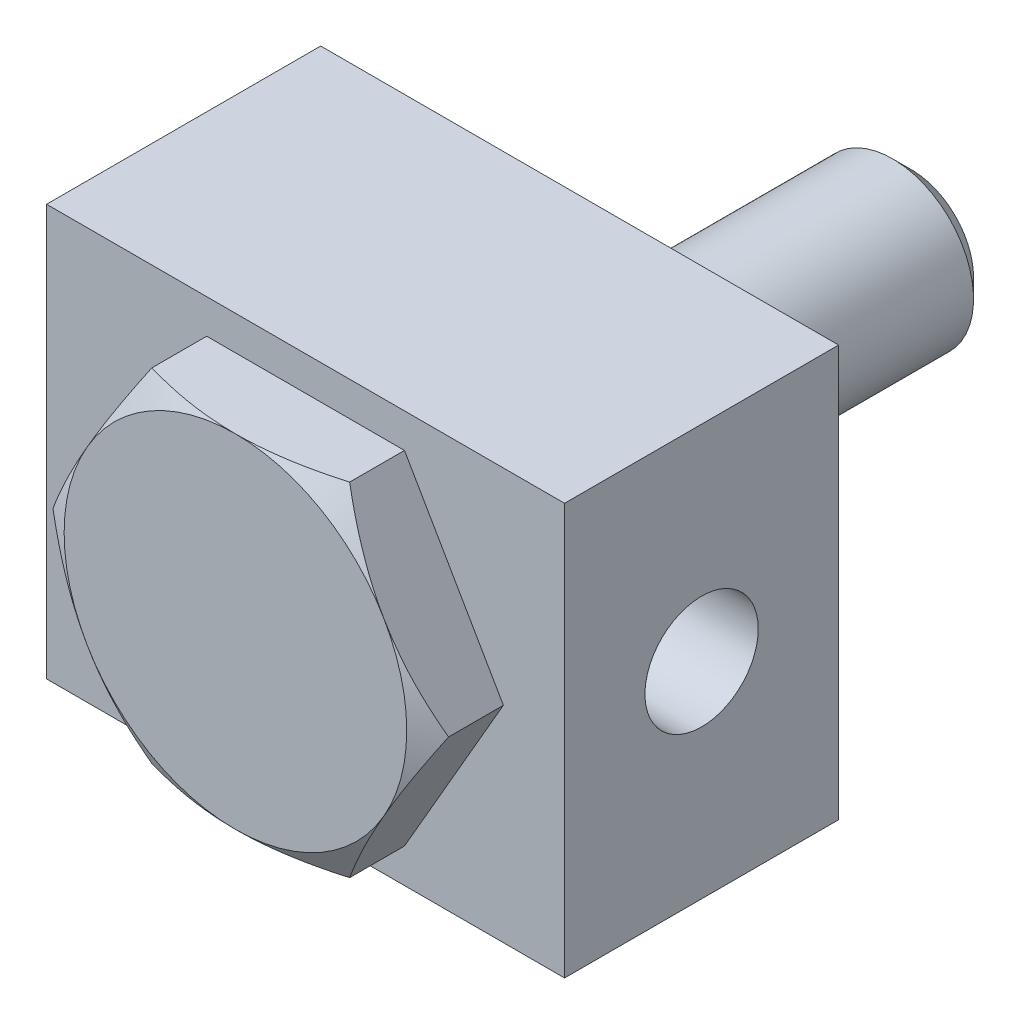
ISO-10303-21;
HEADER;
FILE_DESCRIPTION(('STEP AP214'),'2;1');
FILE_NAME('part.step','',(''),(''),'','','');
FILE_SCHEMA(('AUTOMOTIVE_DESIGN { 1 0 10303 214 1 1 1 1 }'));
ENDSEC;
DATA;
#1=APPLICATION_CONTEXT('core data for automotive mechanical design processes');
#2=APPLICATION_PROTOCOL_DEFINITION('international standard','automotive_design',2000,#1);
#3=PRODUCT_CONTEXT('',#1,'mechanical');
#4=PRODUCT('Part','Part','',(#3));
#5=PRODUCT_RELATED_PRODUCT_CATEGORY('part','',(#4));
#6=PRODUCT_DEFINITION_FORMATION('','',#4);
#7=PRODUCT_DEFINITION_CONTEXT('part definition',#1,'design');
#8=PRODUCT_DEFINITION('design','',#6,#7);
#9=PRODUCT_DEFINITION_SHAPE('','',#8);
#10=(LENGTH_UNIT() NAMED_UNIT(*) SI_UNIT(.MILLI.,.METRE.));
#11=(NAMED_UNIT(*) PLANE_ANGLE_UNIT() SI_UNIT($,.RADIAN.));
#12=(NAMED_UNIT(*) SI_UNIT($,.STERADIAN.) SOLID_ANGLE_UNIT());
#13=UNCERTAINTY_MEASURE_WITH_UNIT(LENGTH_MEASURE(1.E-05),#10,'distance_accuracy_value','');
#14=(GEOMETRIC_REPRESENTATION_CONTEXT(3) GLOBAL_UNCERTAINTY_ASSIGNED_CONTEXT((#13)) GLOBAL_UNIT_ASSIGNED_CONTEXT((#10,
#11,#12)) REPRESENTATION_CONTEXT('',''));
#15=CARTESIAN_POINT('',(0.,0.,0.));
#16=DIRECTION('',(0.,0.,1.));
#17=DIRECTION('',(1.,0.,0.));
#18=AXIS2_PLACEMENT_3D('',#15,#16,#17);
#19=CARTESIAN_POINT('',(-18.3308710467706,31.75,70.3));
#20=DIRECTION('',(0.866025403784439,-0.5,0.));
#21=DIRECTION('',(0.5,0.866025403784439,0.));
#22=AXIS2_PLACEMENT_3D('',#19,#20,#21);
#23=PLANE('',#22);
#24=CARTESIAN_POINT('',(-18.3307555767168,31.7502,62.4641377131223));
#25=CARTESIAN_POINT('',(-18.7336598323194,31.0523493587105,62.6967369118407));
#26=CARTESIAN_POINT('',(-19.13813562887,30.3517767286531,62.9187809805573));
#27=CARTESIAN_POINT('',(-19.9503306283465,28.9450137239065,63.3388249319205));
#28=CARTESIAN_POINT('',(-20.358050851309,28.238821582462,63.5368169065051));
#29=CARTESIAN_POINT('',(-21.1775313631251,26.8194397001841,63.906099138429));
#30=CARTESIAN_POINT('',(-21.5892988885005,26.1062374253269,64.0773256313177));
#31=CARTESIAN_POINT('',(-22.4156776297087,24.6749074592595,64.3893882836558));
#32=CARTESIAN_POINT('',(-22.8302885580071,23.9567802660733,64.5302274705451));
#33=CARTESIAN_POINT('',(-23.6517563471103,22.5339563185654,64.7755371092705));
#34=CARTESIAN_POINT('',(-24.0585522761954,21.8293651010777,64.8808188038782));
#35=CARTESIAN_POINT('',(-24.8740080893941,20.4169542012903,65.0573518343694));
#36=CARTESIAN_POINT('',(-25.2826680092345,19.7091344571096,65.1286025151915));
#37=CARTESIAN_POINT('',(-26.100674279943,18.2923060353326,65.2352744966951));
#38=CARTESIAN_POINT('',(-26.5100192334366,17.5832997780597,65.2707383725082));
#39=CARTESIAN_POINT('',(-27.3290869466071,16.1646328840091,65.3050740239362));
#40=CARTESIAN_POINT('',(-27.7388096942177,15.4549722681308,65.3039469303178));
#41=CARTESIAN_POINT('',(-28.5047899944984,14.1282554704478,65.2676569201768));
#42=CARTESIAN_POINT('',(-28.8611021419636,13.5111047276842,65.2369192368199));
#43=CARTESIAN_POINT('',(-29.5728766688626,12.2782750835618,65.1483534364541));
#44=CARTESIAN_POINT('',(-29.9283390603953,11.6625961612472,65.0905257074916));
#45=CARTESIAN_POINT('',(-30.6382785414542,10.4329449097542,64.9487854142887));
#46=CARTESIAN_POINT('',(-30.9927544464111,9.81897463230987,64.8648492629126));
#47=CARTESIAN_POINT('',(-31.7000213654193,8.59395239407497,64.6723649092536));
#48=CARTESIAN_POINT('',(-32.0528123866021,7.98290042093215,64.5638168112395));
#49=CARTESIAN_POINT('',(-32.7641994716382,6.75074184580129,64.3211744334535));
#50=CARTESIAN_POINT('',(-33.1227517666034,6.12971105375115,64.186569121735));
#51=CARTESIAN_POINT('',(-33.8376618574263,4.89145045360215,63.895403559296));
#52=CARTESIAN_POINT('',(-34.1940193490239,4.27422117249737,63.7388403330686));
#53=CARTESIAN_POINT('',(-34.9037042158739,3.04501092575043,63.4061282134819));
#54=CARTESIAN_POINT('',(-35.2570361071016,2.43302213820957,63.2300176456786));
#55=CARTESIAN_POINT('',(-35.9612560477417,1.21327742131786,62.8599677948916));
#56=CARTESIAN_POINT('',(-36.3121447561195,0.605520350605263,62.6660335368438));
#57=CARTESIAN_POINT('',(-36.6618575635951,-0.000200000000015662,62.4641377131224));
#58=B_SPLINE_CURVE_WITH_KNOTS('',3,(#24,#25,#26,#27,#28,#29,#30,#31,#32,#33,#34,#35,#36,#37,#38,
#39,#40,#41,#42,#43,#44,#45,#46,#47,#48,#49,#50,#51,#52,#53,#54,#55,#56,#57),.UNSPECIFIED.,.F.,
.F.,(4,2,2,2,2,2,2,2,2,2,2,2,2,2,2,2,4),(0.,2.51618738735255,5.03319984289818,7.55612017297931,
10.078789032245,12.5392457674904,14.999749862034,17.4573232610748,19.9148207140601,
22.0541658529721,24.1934803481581,26.3347332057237,28.4759769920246,30.6644883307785,
32.8532965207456,35.0378865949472,37.2218626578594),.UNSPECIFIED.);
#59=CARTESIAN_POINT('',(-18.3308710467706,31.75,62.464204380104));
#60=VERTEX_POINT('',#59);
#61=CARTESIAN_POINT('',(-27.496306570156,15.875,65.3));
#62=VERTEX_POINT('',#61);
#63=EDGE_CURVE('E110',#60,#62,#58,.T.);
#64=ORIENTED_EDGE('',*,*,#63,.F.);
#65=DIRECTION('',(0.,0.,-1.));
#66=VECTOR('',#65,1.);
#67=CARTESIAN_POINT('',(-18.3308710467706,31.75,70.3));
#68=LINE('',#67,#66);
#69=CARTESIAN_POINT('',(-18.3308710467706,31.75,52.3));
#70=VERTEX_POINT('',#69);
#71=EDGE_CURVE('E387',#60,#70,#68,.T.);
#72=ORIENTED_EDGE('',*,*,#71,.T.);
#73=DIRECTION('',(-0.5,-0.866025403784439,0.));
#74=VECTOR('',#73,1.);
#75=CARTESIAN_POINT('',(-18.3308710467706,31.75,52.3));
#76=LINE('',#75,#74);
#77=CARTESIAN_POINT('',(-36.6617420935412,0.,52.3));
#78=VERTEX_POINT('',#77);
#79=EDGE_CURVE('E119',#70,#78,#76,.T.);
#80=ORIENTED_EDGE('',*,*,#79,.T.);
#81=DIRECTION('',(0.,0.,-1.));
#82=VECTOR('',#81,1.);
#83=CARTESIAN_POINT('',(-36.6617420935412,0.,70.3));
#84=LINE('',#83,#82);
#85=CARTESIAN_POINT('',(-36.6617420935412,0.,62.464204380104));
#86=VERTEX_POINT('',#85);
#87=EDGE_CURVE('E138',#86,#78,#84,.T.);
#88=ORIENTED_EDGE('',*,*,#87,.F.);
#89=EDGE_CURVE('E120',#62,#86,#58,.T.);
#90=ORIENTED_EDGE('',*,*,#89,.F.);
#91=EDGE_LOOP('',(#64,#72,#80,#88,#90));
#92=FACE_BOUND('',#91,.T.);
#93=ADVANCED_FACE('F16',(#92),#23,.F.);
#94=CARTESIAN_POINT('',(-36.6617420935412,0.,70.3));
#95=DIRECTION('',(0.866025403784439,0.5,0.));
#96=DIRECTION('',(-0.5,0.866025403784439,0.));
#97=AXIS2_PLACEMENT_3D('',#94,#95,#96);
#98=PLANE('',#97);
#99=CARTESIAN_POINT('',(-36.6618575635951,0.000199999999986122,62.4641377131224));
#100=CARTESIAN_POINT('',(-36.2589533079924,-0.69765064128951,62.6967369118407));
#101=CARTESIAN_POINT('',(-35.8544775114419,-1.39822327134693,62.9187809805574));
#102=CARTESIAN_POINT('',(-35.0422825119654,-2.80498627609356,63.3388249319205));
#103=CARTESIAN_POINT('',(-34.6345622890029,-3.51117841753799,63.5368169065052));
#104=CARTESIAN_POINT('',(-33.8150817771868,-4.93056029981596,63.906099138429));
#105=CARTESIAN_POINT('',(-33.4033142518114,-5.64376257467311,64.0773256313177));
#106=CARTESIAN_POINT('',(-32.5769355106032,-7.07509254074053,64.3893882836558));
#107=CARTESIAN_POINT('',(-32.1623245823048,-7.79321973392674,64.5302274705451));
#108=CARTESIAN_POINT('',(-31.3408567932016,-9.21604368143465,64.7755371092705));
#109=CARTESIAN_POINT('',(-30.9340608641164,-9.92063489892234,64.8808188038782));
#110=CARTESIAN_POINT('',(-30.1186050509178,-11.3330457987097,65.0573518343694));
#111=CARTESIAN_POINT('',(-29.7099451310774,-12.0408655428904,65.1286025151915));
#112=CARTESIAN_POINT('',(-28.8919388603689,-13.4576939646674,65.2352744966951));
#113=CARTESIAN_POINT('',(-28.4825939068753,-14.1667002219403,65.2707383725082));
#114=CARTESIAN_POINT('',(-27.6635261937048,-15.5853671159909,65.3050740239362));
#115=CARTESIAN_POINT('',(-27.2538034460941,-16.2950277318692,65.3039469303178));
#116=CARTESIAN_POINT('',(-26.4878231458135,-17.6217445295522,65.2676569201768));
#117=CARTESIAN_POINT('',(-26.1315109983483,-18.2388952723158,65.2369192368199));
#118=CARTESIAN_POINT('',(-25.4197364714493,-19.4717249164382,65.1483534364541));
#119=CARTESIAN_POINT('',(-25.0642740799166,-20.0874038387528,65.0905257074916));
#120=CARTESIAN_POINT('',(-24.3543345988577,-21.3170550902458,64.9487854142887));
#121=CARTESIAN_POINT('',(-23.9998586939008,-21.9310253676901,64.8648492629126));
#122=CARTESIAN_POINT('',(-23.2925917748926,-23.156047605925,64.6723649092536));
#123=CARTESIAN_POINT('',(-22.9398007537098,-23.7670995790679,64.5638168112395));
#124=CARTESIAN_POINT('',(-22.2284136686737,-24.9992581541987,64.3211744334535));
#125=CARTESIAN_POINT('',(-21.8698613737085,-25.6202889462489,64.1865691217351));
#126=CARTESIAN_POINT('',(-21.1549512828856,-26.8585495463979,63.895403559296));
#127=CARTESIAN_POINT('',(-20.798593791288,-27.4757788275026,63.7388403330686));
#128=CARTESIAN_POINT('',(-20.088908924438,-28.7049890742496,63.4061282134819));
#129=CARTESIAN_POINT('',(-19.7355770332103,-29.3169778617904,63.2300176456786));
#130=CARTESIAN_POINT('',(-19.0313570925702,-30.5367225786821,62.8599677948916));
#131=CARTESIAN_POINT('',(-18.6804683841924,-31.1444796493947,62.6660335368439));
#132=CARTESIAN_POINT('',(-18.3307555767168,-31.7502,62.4641377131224));
#133=B_SPLINE_CURVE_WITH_KNOTS('',3,(#99,#100,#101,#102,#103,#104,#105,#106,#107,#108,#109,#110,
#111,#112,#113,#114,#115,#116,#117,#118,#119,#120,#121,#122,#123,#124,#125,#126,#127,#128,#129,
#130,#131,#132),.UNSPECIFIED.,.F.,.F.,(4,2,2,2,2,2,2,2,2,2,2,2,2,2,2,2,4),(0.,2.51618738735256,
5.03319984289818,7.5561201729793,10.078789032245,12.5392457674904,14.999749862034,
17.4573232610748,19.9148207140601,22.054165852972,24.193480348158,26.3347332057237,
28.4759769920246,30.6644883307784,32.8532965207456,35.0378865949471,37.2218626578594),.UNSPECIFIED.);
#134=CARTESIAN_POINT('',(-27.496306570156,-15.875,65.3));
#135=VERTEX_POINT('',#134);
#136=EDGE_CURVE('E127',#86,#135,#133,.T.);
#137=ORIENTED_EDGE('',*,*,#136,.F.);
#138=ORIENTED_EDGE('',*,*,#87,.T.);
#139=DIRECTION('',(0.5,-0.866025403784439,0.));
#140=VECTOR('',#139,1.);
#141=CARTESIAN_POINT('',(-36.6617420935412,0.,52.3));
#142=LINE('',#141,#140);
#143=CARTESIAN_POINT('',(-18.3308710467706,-31.75,52.3));
#144=VERTEX_POINT('',#143);
#145=EDGE_CURVE('E395',#78,#144,#142,.T.);
#146=ORIENTED_EDGE('',*,*,#145,.T.);
#147=DIRECTION('',(0.,0.,-1.));
#148=VECTOR('',#147,1.);
#149=CARTESIAN_POINT('',(-18.3308710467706,-31.75,70.3));
#150=LINE('',#149,#148);
#151=CARTESIAN_POINT('',(-18.3308710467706,-31.75,62.464204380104));
#152=VERTEX_POINT('',#151);
#153=EDGE_CURVE('E216',#152,#144,#150,.T.);
#154=ORIENTED_EDGE('',*,*,#153,.F.);
#155=EDGE_CURVE('E139',#135,#152,#133,.T.);
#156=ORIENTED_EDGE('',*,*,#155,.F.);
#157=EDGE_LOOP('',(#137,#138,#146,#154,#156));
#158=FACE_BOUND('',#157,.T.);
#159=ADVANCED_FACE('F202',(#158),#98,.F.);
#160=CARTESIAN_POINT('',(-18.3308710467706,-31.75,70.3));
#161=DIRECTION('',(0.,1.,0.));
#162=DIRECTION('',(-1.,0.,0.));
#163=AXIS2_PLACEMENT_3D('',#160,#161,#162);
#164=PLANE('',#163);
#165=CARTESIAN_POINT('',(-49.0609987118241,-31.75,49.8914574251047));
#166=CARTESIAN_POINT('',(-48.3684107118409,-31.75,50.2271485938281));
#167=CARTESIAN_POINT('',(-47.6750046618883,-31.75,50.5611570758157));
#168=CARTESIAN_POINT('',(-46.2863868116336,-31.75,51.2254164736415));
#169=CARTESIAN_POINT('',(-45.5911749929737,-31.75,51.5556673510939));
#170=CARTESIAN_POINT('',(-44.1986810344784,-31.75,52.2120638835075));
#171=CARTESIAN_POINT('',(-43.5013985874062,-31.75,52.5382088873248));
#172=CARTESIAN_POINT('',(-42.1046897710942,-31.75,53.1858689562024));
#173=CARTESIAN_POINT('',(-41.4052634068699,-31.75,53.5073840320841));
#174=CARTESIAN_POINT('',(-39.29574648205,-31.75,54.4677329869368));
#175=CARTESIAN_POINT('',(-37.8820802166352,-31.75,55.0987453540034));
#176=CARTESIAN_POINT('',(-35.0434372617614,-31.75,56.3347449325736));
#177=CARTESIAN_POINT('',(-33.6184611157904,-31.75,56.9397333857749));
#178=CARTESIAN_POINT('',(-31.4481556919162,-31.75,57.8317691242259));
#179=CARTESIAN_POINT('',(-30.7078021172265,-31.75,58.1309335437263));
#180=CARTESIAN_POINT('',(-29.2231292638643,-31.75,58.7192803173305));
#181=CARTESIAN_POINT('',(-28.4788099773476,-31.75,59.008462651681));
#182=CARTESIAN_POINT('',(-26.9857641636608,-31.75,59.5755330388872));
#183=CARTESIAN_POINT('',(-26.2370370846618,-31.75,59.8534196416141));
#184=CARTESIAN_POINT('',(-24.7349201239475,-31.75,60.3963012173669));
#185=CARTESIAN_POINT('',(-23.9815302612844,-31.75,60.6612962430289));
#186=CARTESIAN_POINT('',(-22.4712971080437,-31.75,61.1760941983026));
#187=CARTESIAN_POINT('',(-21.7144642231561,-31.75,61.4259275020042));
#188=CARTESIAN_POINT('',(-20.1955328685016,-31.75,61.90898962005));
#189=CARTESIAN_POINT('',(-19.4334343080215,-31.75,62.1422181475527));
#190=CARTESIAN_POINT('',(-17.1392161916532,-31.75,62.8136001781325));
#191=CARTESIAN_POINT('',(-15.5985913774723,-31.75,63.2236522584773));
#192=CARTESIAN_POINT('',(-13.2752970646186,-31.75,63.7663407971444));
#193=CARTESIAN_POINT('',(-12.5009089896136,-31.75,63.9348146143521));
#194=CARTESIAN_POINT('',(-10.9468685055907,-31.75,64.2456093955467));
#195=CARTESIAN_POINT('',(-10.1672162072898,-31.75,64.3879309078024));
#196=CARTESIAN_POINT('',(-8.60321979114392,-31.75,64.6438959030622));
#197=CARTESIAN_POINT('',(-7.81887581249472,-31.75,64.7575402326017));
#198=CARTESIAN_POINT('',(-6.24629654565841,-31.75,64.953884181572));
#199=CARTESIAN_POINT('',(-5.4580612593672,-31.75,65.036583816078));
#200=CARTESIAN_POINT('',(-3.88905799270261,-31.75,65.1683616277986));
#201=CARTESIAN_POINT('',(-3.10832565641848,-31.75,65.2178617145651));
#202=CARTESIAN_POINT('',(-1.54546751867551,-31.75,65.2838124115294));
#203=CARTESIAN_POINT('',(-0.763341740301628,-31.75,65.3002635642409));
#204=CARTESIAN_POINT('',(0.80090033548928,-31.75,65.2997300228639));
#205=CARTESIAN_POINT('',(1.58301663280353,-31.75,65.2827450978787));
#206=CARTESIAN_POINT('',(3.14586968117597,-31.75,65.215734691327));
#207=CARTESIAN_POINT('',(3.92660636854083,-31.75,65.1657077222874));
#208=CARTESIAN_POINT('',(5.25717405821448,-31.75,65.0530813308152));
#209=CARTESIAN_POINT('',(5.80769556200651,-31.75,64.9984491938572));
#210=CARTESIAN_POINT('',(6.90700558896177,-31.75,64.8738397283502));
#211=CARTESIAN_POINT('',(7.45579406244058,-31.75,64.8038619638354));
#212=CARTESIAN_POINT('',(9.09913998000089,-31.75,64.5719348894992));
#213=CARTESIAN_POINT('',(10.1906479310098,-31.75,64.3879944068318));
#214=CARTESIAN_POINT('',(12.3643105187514,-31.75,63.96798055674));
#215=CARTESIAN_POINT('',(13.4464570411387,-31.75,63.7318659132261));
#216=CARTESIAN_POINT('',(15.5998610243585,-31.75,63.2147070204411));
#217=CARTESIAN_POINT('',(16.6711186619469,-31.75,62.9336635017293));
#218=CARTESIAN_POINT('',(18.8260878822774,-31.75,62.3268831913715));
#219=CARTESIAN_POINT('',(19.9095606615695,-31.75,62.0003045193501));
#220=CARTESIAN_POINT('',(22.065830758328,-31.75,61.3138040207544));
#221=CARTESIAN_POINT('',(23.1386280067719,-31.75,60.9538819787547));
#222=CARTESIAN_POINT('',(25.2740913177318,-31.75,60.2063728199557));
#223=CARTESIAN_POINT('',(26.3367607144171,-31.75,59.8187951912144));
#224=CARTESIAN_POINT('',(27.9241682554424,-31.75,59.22007093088));
#225=CARTESIAN_POINT('',(28.452204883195,-31.75,59.0176031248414));
#226=CARTESIAN_POINT('',(29.5062159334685,-31.75,58.6073631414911));
#227=CARTESIAN_POINT('',(30.0321903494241,-31.75,58.399590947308));
#228=CARTESIAN_POINT('',(31.941261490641,-31.75,57.6352911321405));
#229=CARTESIAN_POINT('',(33.3186160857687,-31.75,57.064387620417));
#230=CARTESIAN_POINT('',(36.0620094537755,-31.75,55.8959695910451));
#231=CARTESIAN_POINT('',(37.4280475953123,-31.75,55.2984536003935));
#232=CARTESIAN_POINT('',(40.1508563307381,-31.75,54.081983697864));
#233=CARTESIAN_POINT('',(41.5076249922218,-31.75,53.4630254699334));
#234=CARTESIAN_POINT('',(44.2131157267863,-31.75,52.2078748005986));
#235=CARTESIAN_POINT('',(45.561837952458,-31.75,51.5716826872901));
#236=CARTESIAN_POINT('',(48.2539031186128,-31.75,50.2845467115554));
#237=CARTESIAN_POINT('',(49.5972391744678,-31.75,49.6335884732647));
#238=CARTESIAN_POINT('',(52.2781978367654,-31.75,48.3200139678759));
#239=CARTESIAN_POINT('',(53.6158204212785,-31.75,47.6573976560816));
#240=CARTESIAN_POINT('',(56.2860541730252,-31.75,46.3225321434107));
#241=CARTESIAN_POINT('',(57.6186658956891,-31.75,45.6502840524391));
#242=CARTESIAN_POINT('',(60.2797370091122,-31.75,44.2976313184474));
#243=CARTESIAN_POINT('',(61.6081964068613,-31.75,43.6172266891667));
#244=CARTESIAN_POINT('',(64.1545838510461,-31.75,42.3046429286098));
#245=CARTESIAN_POINT('',(65.3727877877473,-31.75,41.6729986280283));
#246=CARTESIAN_POINT('',(67.8065601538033,-31.75,40.4046512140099));
#247=CARTESIAN_POINT('',(69.0221285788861,-31.75,39.7679480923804));
#248=CARTESIAN_POINT('',(72.6654502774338,-31.75,37.8512322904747));
#249=CARTESIAN_POINT('',(75.0897489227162,-31.75,36.5646499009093));
#250=CARTESIAN_POINT('',(78.7179557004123,-31.75,34.6262068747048));
#251=CARTESIAN_POINT('',(79.924569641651,-31.75,33.979396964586));
#252=CARTESIAN_POINT('',(82.3361973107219,-31.75,32.6827982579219));
#253=CARTESIAN_POINT('',(83.5412110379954,-31.75,32.0330094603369));
#254=CARTESIAN_POINT('',(85.9497498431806,-31.75,30.7308286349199));
#255=CARTESIAN_POINT('',(87.153274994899,-31.75,30.0784367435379));
#256=CARTESIAN_POINT('',(89.5590411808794,-31.75,28.7712938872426));
#257=CARTESIAN_POINT('',(90.7612822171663,-31.75,28.1165429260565));
#258=CARTESIAN_POINT('',(91.9629541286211,-31.75,27.4607501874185));
#259=B_SPLINE_CURVE_WITH_KNOTS('',3,(#165,#166,#167,#168,#169,#170,#171,#172,#173,#174,#175,
#176,#177,#178,#179,#180,#181,#182,#183,#184,#185,#186,#187,#188,#189,#190,#191,#192,#193,#194,
#195,#196,#197,#198,#199,#200,#201,#202,#203,#204,#205,#206,#207,#208,#209,#210,#211,#212,#213,
#214,#215,#216,#217,#218,#219,#220,#221,#222,#223,#224,#225,#226,#227,#228,#229,#230,#231,#232,
#233,#234,#235,#236,#237,#238,#239,#240,#241,#242,#243,#244,#245,#246,#247,#248,#249,#250,#251,
#252,#253,#254,#255,#256,#257,#258),.UNSPECIFIED.,.F.,.F.,(4,2,2,2,2,2,2,2,2,2,2,2,2,2,2,2,2,2,
2,2,2,2,2,2,2,2,2,2,2,2,2,2,2,2,2,2,2,2,2,2,2,2,2,2,2,2,4),(0.,2.30896175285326,
4.61794707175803,6.92729406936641,9.23663566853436,13.8807459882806,18.5246344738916,
20.9201141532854,23.3155985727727,25.7113895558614,28.1071707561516,30.4979821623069,
32.8888348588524,37.668691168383,40.0458440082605,42.4229470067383,44.7999798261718,
47.1770114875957,49.5232318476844,51.8694136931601,54.2156117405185,56.5619154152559,
58.2213801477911,59.8808920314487,63.2000059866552,66.5217552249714,69.8434504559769,
73.2376744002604,76.6319202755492,80.025007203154,81.721552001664,83.4181021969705,
87.890651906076,92.3634494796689,96.8371526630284,101.310770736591,105.788948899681,
110.267144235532,114.744827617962,119.222503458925,123.339158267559,127.455819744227,
135.689382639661,139.796511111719,143.903641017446,148.01055839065,152.117469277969),.UNSPECIFIED.);
#260=CARTESIAN_POINT('',(0.,-31.75,65.3));
#261=VERTEX_POINT('',#260);
#262=EDGE_CURVE('E196',#152,#261,#259,.T.);
#263=ORIENTED_EDGE('',*,*,#262,.F.);
#264=ORIENTED_EDGE('',*,*,#153,.T.);
#265=DIRECTION('',(1.,0.,0.));
#266=VECTOR('',#265,1.);
#267=CARTESIAN_POINT('',(-18.3308710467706,-31.75,52.3));
#268=LINE('',#267,#266);
#269=CARTESIAN_POINT('',(18.3308710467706,-31.75,52.3));
#270=VERTEX_POINT('',#269);
#271=EDGE_CURVE('E234',#144,#270,#268,.T.);
#272=ORIENTED_EDGE('',*,*,#271,.T.);
#273=DIRECTION('',(0.,0.,-1.));
#274=VECTOR('',#273,1.);
#275=CARTESIAN_POINT('',(18.3308710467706,-31.75,70.3));
#276=LINE('',#275,#274);
#277=CARTESIAN_POINT('',(18.3308710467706,-31.75,62.464204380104));
#278=VERTEX_POINT('',#277);
#279=EDGE_CURVE('E232',#278,#270,#276,.T.);
#280=ORIENTED_EDGE('',*,*,#279,.F.);
#281=EDGE_CURVE('E190',#261,#278,#259,.T.);
#282=ORIENTED_EDGE('',*,*,#281,.F.);
#283=EDGE_LOOP('',(#263,#264,#272,#280,#282));
#284=FACE_BOUND('',#283,.T.);
#285=ADVANCED_FACE('F198',(#284),#164,.F.);
#286=CARTESIAN_POINT('',(18.3308710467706,-31.75,70.3));
#287=DIRECTION('',(-0.866025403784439,0.5,0.));
#288=DIRECTION('',(-0.5,-0.866025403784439,0.));
#289=AXIS2_PLACEMENT_3D('',#286,#287,#288);
#290=PLANE('',#289);
#291=CARTESIAN_POINT('',(18.3307555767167,-31.7502,62.4641377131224));
#292=CARTESIAN_POINT('',(18.7336598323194,-31.0523493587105,62.6967369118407));
#293=CARTESIAN_POINT('',(19.1381356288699,-30.3517767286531,62.9187809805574));
#294=CARTESIAN_POINT('',(19.9503306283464,-28.9450137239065,63.3388249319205));
#295=CARTESIAN_POINT('',(20.358050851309,-28.238821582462,63.5368169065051));
#296=CARTESIAN_POINT('',(21.177531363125,-26.8194397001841,63.9060991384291));
#297=CARTESIAN_POINT('',(21.5892988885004,-26.1062374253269,64.0773256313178));
#298=CARTESIAN_POINT('',(22.4156776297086,-24.6749074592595,64.3893882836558));
#299=CARTESIAN_POINT('',(22.8302885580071,-23.9567802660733,64.5302274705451));
#300=CARTESIAN_POINT('',(23.6517563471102,-22.5339563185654,64.7755371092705));
#301=CARTESIAN_POINT('',(24.0585522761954,-21.8293651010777,64.8808188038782));
#302=CARTESIAN_POINT('',(24.874008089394,-20.4169542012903,65.0573518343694));
#303=CARTESIAN_POINT('',(25.2826680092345,-19.7091344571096,65.1286025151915));
#304=CARTESIAN_POINT('',(26.1006742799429,-18.2923060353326,65.2352744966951));
#305=CARTESIAN_POINT('',(26.5100192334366,-17.5832997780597,65.2707383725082));
#306=CARTESIAN_POINT('',(27.3290869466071,-16.1646328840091,65.3050740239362));
#307=CARTESIAN_POINT('',(27.7388096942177,-15.4549722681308,65.3039469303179));
#308=CARTESIAN_POINT('',(28.5047899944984,-14.1282554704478,65.2676569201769));
#309=CARTESIAN_POINT('',(28.8611021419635,-13.5111047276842,65.2369192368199));
#310=CARTESIAN_POINT('',(29.5728766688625,-12.2782750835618,65.1483534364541));
#311=CARTESIAN_POINT('',(29.9283390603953,-11.6625961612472,65.0905257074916));
#312=CARTESIAN_POINT('',(30.6382785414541,-10.4329449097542,64.9487854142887));
#313=CARTESIAN_POINT('',(30.992754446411,-9.81897463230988,64.8648492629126));
#314=CARTESIAN_POINT('',(31.7000213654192,-8.59395239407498,64.6723649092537));
#315=CARTESIAN_POINT('',(32.0528123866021,-7.98290042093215,64.5638168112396));
#316=CARTESIAN_POINT('',(32.7641994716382,-6.75074184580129,64.3211744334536));
#317=CARTESIAN_POINT('',(33.1227517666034,-6.12971105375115,64.1865691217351));
#318=CARTESIAN_POINT('',(33.8376618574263,-4.89145045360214,63.895403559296));
#319=CARTESIAN_POINT('',(34.1940193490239,-4.27422117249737,63.7388403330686));
#320=CARTESIAN_POINT('',(34.9037042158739,-3.04501092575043,63.406128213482));
#321=CARTESIAN_POINT('',(35.2570361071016,-2.43302213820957,63.2300176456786));
#322=CARTESIAN_POINT('',(35.9612560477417,-1.21327742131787,62.8599677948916));
#323=CARTESIAN_POINT('',(36.3121447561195,-0.605520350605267,62.6660335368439));
#324=CARTESIAN_POINT('',(36.661857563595,0.000200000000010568,62.4641377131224));
#325=B_SPLINE_CURVE_WITH_KNOTS('',3,(#291,#292,#293,#294,#295,#296,#297,#298,#299,#300,#301,
#302,#303,#304,#305,#306,#307,#308,#309,#310,#311,#312,#313,#314,#315,#316,#317,#318,#319,#320,
#321,#322,#323,#324),.UNSPECIFIED.,.F.,.F.,(4,2,2,2,2,2,2,2,2,2,2,2,2,2,2,2,4),(0.,
2.51618738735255,5.03319984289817,7.5561201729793,10.078789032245,12.5392457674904,
14.999749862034,17.4573232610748,19.9148207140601,22.054165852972,24.193480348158,
26.3347332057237,28.4759769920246,30.6644883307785,32.8532965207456,35.0378865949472,
37.2218626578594),.UNSPECIFIED.);
#326=CARTESIAN_POINT('',(27.496306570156,-15.875,65.3));
#327=VERTEX_POINT('',#326);
#328=EDGE_CURVE('E197',#278,#327,#325,.T.);
#329=ORIENTED_EDGE('',*,*,#328,.F.);
#330=ORIENTED_EDGE('',*,*,#279,.T.);
#331=DIRECTION('',(0.5,0.866025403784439,0.));
#332=VECTOR('',#331,1.);
#333=CARTESIAN_POINT('',(18.3308710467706,-31.75,52.3));
#334=LINE('',#333,#332);
#335=CARTESIAN_POINT('',(36.6617420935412,0.,52.3));
#336=VERTEX_POINT('',#335);
#337=EDGE_CURVE('E393',#270,#336,#334,.T.);
#338=ORIENTED_EDGE('',*,*,#337,.T.);
#339=DIRECTION('',(0.,0.,-1.));
#340=VECTOR('',#339,1.);
#341=CARTESIAN_POINT('',(36.6617420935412,0.,70.3));
#342=LINE('',#341,#340);
#343=CARTESIAN_POINT('',(36.6617420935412,0.,62.464204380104));
#344=VERTEX_POINT('',#343);
#345=EDGE_CURVE('E238',#344,#336,#342,.T.);
#346=ORIENTED_EDGE('',*,*,#345,.F.);
#347=EDGE_CURVE('E184',#327,#344,#325,.T.);
#348=ORIENTED_EDGE('',*,*,#347,.F.);
#349=EDGE_LOOP('',(#329,#330,#338,#346,#348));
#350=FACE_BOUND('',#349,.T.);
#351=ADVANCED_FACE('F201',(#350),#290,.F.);
#352=CARTESIAN_POINT('',(36.6617420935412,0.,70.3));
#353=DIRECTION('',(-0.866025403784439,-0.5,0.));
#354=DIRECTION('',(0.5,-0.866025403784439,0.));
#355=AXIS2_PLACEMENT_3D('',#352,#353,#354);
#356=PLANE('',#355);
#357=CARTESIAN_POINT('',(36.661857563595,-0.000199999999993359,62.4641377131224));
#358=CARTESIAN_POINT('',(36.2589533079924,0.697650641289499,62.6967369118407));
#359=CARTESIAN_POINT('',(35.8544775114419,1.39822327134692,62.9187809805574));
#360=CARTESIAN_POINT('',(35.0422825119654,2.80498627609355,63.3388249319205));
#361=CARTESIAN_POINT('',(34.6345622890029,3.51117841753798,63.5368169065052));
#362=CARTESIAN_POINT('',(33.8150817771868,4.93056029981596,63.9060991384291));
#363=CARTESIAN_POINT('',(33.4033142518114,5.6437625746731,64.0773256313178));
#364=CARTESIAN_POINT('',(32.5769355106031,7.07509254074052,64.3893882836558));
#365=CARTESIAN_POINT('',(32.1623245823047,7.79321973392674,64.5302274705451));
#366=CARTESIAN_POINT('',(31.3408567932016,9.21604368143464,64.7755371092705));
#367=CARTESIAN_POINT('',(30.9340608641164,9.92063489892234,64.8808188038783));
#368=CARTESIAN_POINT('',(30.1186050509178,11.3330457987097,65.0573518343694));
#369=CARTESIAN_POINT('',(29.7099451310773,12.0408655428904,65.1286025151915));
#370=CARTESIAN_POINT('',(28.8919388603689,13.4576939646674,65.2352744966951));
#371=CARTESIAN_POINT('',(28.4825939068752,14.1667002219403,65.2707383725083));
#372=CARTESIAN_POINT('',(27.6635261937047,15.5853671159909,65.3050740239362));
#373=CARTESIAN_POINT('',(27.2538034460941,16.2950277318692,65.3039469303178));
#374=CARTESIAN_POINT('',(26.4878231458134,17.6217445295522,65.2676569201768));
#375=CARTESIAN_POINT('',(26.1315109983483,18.2388952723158,65.2369192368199));
#376=CARTESIAN_POINT('',(25.4197364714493,19.4717249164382,65.1483534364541));
#377=CARTESIAN_POINT('',(25.0642740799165,20.0874038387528,65.0905257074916));
#378=CARTESIAN_POINT('',(24.3543345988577,21.3170550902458,64.9487854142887));
#379=CARTESIAN_POINT('',(23.9998586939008,21.9310253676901,64.8648492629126));
#380=CARTESIAN_POINT('',(23.2925917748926,23.156047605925,64.6723649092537));
#381=CARTESIAN_POINT('',(22.9398007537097,23.7670995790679,64.5638168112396));
#382=CARTESIAN_POINT('',(22.2284136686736,24.9992581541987,64.3211744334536));
#383=CARTESIAN_POINT('',(21.8698613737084,25.6202889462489,64.1865691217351));
#384=CARTESIAN_POINT('',(21.1549512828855,26.8585495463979,63.895403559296));
#385=CARTESIAN_POINT('',(20.7985937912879,27.4757788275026,63.7388403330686));
#386=CARTESIAN_POINT('',(20.088908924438,28.7049890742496,63.406128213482));
#387=CARTESIAN_POINT('',(19.7355770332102,29.3169778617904,63.2300176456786));
#388=CARTESIAN_POINT('',(19.0313570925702,30.5367225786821,62.8599677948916));
#389=CARTESIAN_POINT('',(18.6804683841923,31.1444796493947,62.6660335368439));
#390=CARTESIAN_POINT('',(18.3307555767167,31.7502,62.4641377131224));
#391=B_SPLINE_CURVE_WITH_KNOTS('',3,(#357,#358,#359,#360,#361,#362,#363,#364,#365,#366,#367,
#368,#369,#370,#371,#372,#373,#374,#375,#376,#377,#378,#379,#380,#381,#382,#383,#384,#385,#386,
#387,#388,#389,#390),.UNSPECIFIED.,.F.,.F.,(4,2,2,2,2,2,2,2,2,2,2,2,2,2,2,2,4),(0.,
2.51618738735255,5.03319984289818,7.5561201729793,10.078789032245,12.5392457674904,
14.999749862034,17.4573232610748,19.9148207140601,22.0541658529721,24.1934803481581,
26.3347332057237,28.4759769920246,30.6644883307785,32.8532965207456,35.0378865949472,
37.2218626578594),.UNSPECIFIED.);
#392=CARTESIAN_POINT('',(27.496306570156,15.875,65.3));
#393=VERTEX_POINT('',#392);
#394=EDGE_CURVE('E398',#344,#393,#391,.T.);
#395=ORIENTED_EDGE('',*,*,#394,.F.);
#396=ORIENTED_EDGE('',*,*,#345,.T.);
#397=DIRECTION('',(-0.5,0.866025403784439,0.));
#398=VECTOR('',#397,1.);
#399=CARTESIAN_POINT('',(36.6617420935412,0.,52.3));
#400=LINE('',#399,#398);
#401=CARTESIAN_POINT('',(18.3308710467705,31.75,52.3));
#402=VERTEX_POINT('',#401);
#403=EDGE_CURVE('E386',#336,#402,#400,.T.);
#404=ORIENTED_EDGE('',*,*,#403,.T.);
#405=DIRECTION('',(0.,0.,-1.));
#406=VECTOR('',#405,1.);
#407=CARTESIAN_POINT('',(18.3308710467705,31.75,70.3));
#408=LINE('',#407,#406);
#409=CARTESIAN_POINT('',(18.3308710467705,31.75,62.464204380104));
#410=VERTEX_POINT('',#409);
#411=EDGE_CURVE('E241',#410,#402,#408,.T.);
#412=ORIENTED_EDGE('',*,*,#411,.F.);
#413=EDGE_CURVE('E177',#393,#410,#391,.T.);
#414=ORIENTED_EDGE('',*,*,#413,.F.);
#415=EDGE_LOOP('',(#395,#396,#404,#412,#414));
#416=FACE_BOUND('',#415,.T.);
#417=ADVANCED_FACE('F366',(#416),#356,.F.);
#418=CARTESIAN_POINT('',(18.3308710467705,31.75,70.3));
#419=DIRECTION('',(0.,-1.,0.));
#420=DIRECTION('',(0.,0.,-1.));
#421=AXIS2_PLACEMENT_3D('',#418,#419,#420);
#422=PLANE('',#421);
#423=CARTESIAN_POINT('',(-49.0609987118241,31.75,49.8914574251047));
#424=CARTESIAN_POINT('',(-48.3684107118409,31.75,50.2271485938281));
#425=CARTESIAN_POINT('',(-47.6750046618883,31.75,50.5611570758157));
#426=CARTESIAN_POINT('',(-46.2863868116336,31.75,51.2254164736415));
#427=CARTESIAN_POINT('',(-45.5911749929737,31.75,51.5556673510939));
#428=CARTESIAN_POINT('',(-44.1986810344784,31.75,52.2120638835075));
#429=CARTESIAN_POINT('',(-43.5013985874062,31.75,52.5382088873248));
#430=CARTESIAN_POINT('',(-42.1046897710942,31.75,53.1858689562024));
#431=CARTESIAN_POINT('',(-41.4052634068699,31.75,53.5073840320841));
#432=CARTESIAN_POINT('',(-39.29574648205,31.75,54.4677329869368));
#433=CARTESIAN_POINT('',(-37.8820802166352,31.75,55.0987453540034));
#434=CARTESIAN_POINT('',(-35.0434372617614,31.75,56.3347449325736));
#435=CARTESIAN_POINT('',(-33.6184611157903,31.75,56.9397333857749));
#436=CARTESIAN_POINT('',(-31.4481556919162,31.75,57.8317691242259));
#437=CARTESIAN_POINT('',(-30.7078021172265,31.75,58.1309335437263));
#438=CARTESIAN_POINT('',(-29.2231292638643,31.75,58.7192803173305));
#439=CARTESIAN_POINT('',(-28.4788099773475,31.75,59.008462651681));
#440=CARTESIAN_POINT('',(-26.9857641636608,31.75,59.5755330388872));
#441=CARTESIAN_POINT('',(-26.2370370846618,31.75,59.8534196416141));
#442=CARTESIAN_POINT('',(-24.7349201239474,31.75,60.3963012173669));
#443=CARTESIAN_POINT('',(-23.9815302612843,31.75,60.6612962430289));
#444=CARTESIAN_POINT('',(-22.4712971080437,31.75,61.1760941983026));
#445=CARTESIAN_POINT('',(-21.7144642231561,31.75,61.4259275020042));
#446=CARTESIAN_POINT('',(-20.1955328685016,31.75,61.90898962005));
#447=CARTESIAN_POINT('',(-19.4334343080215,31.75,62.1422181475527));
#448=CARTESIAN_POINT('',(-17.1392161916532,31.75,62.8136001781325));
#449=CARTESIAN_POINT('',(-15.5985913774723,31.75,63.2236522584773));
#450=CARTESIAN_POINT('',(-13.2752970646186,31.75,63.7663407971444));
#451=CARTESIAN_POINT('',(-12.5009089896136,31.75,63.9348146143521));
#452=CARTESIAN_POINT('',(-10.9468685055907,31.75,64.2456093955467));
#453=CARTESIAN_POINT('',(-10.1672162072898,31.75,64.3879309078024));
#454=CARTESIAN_POINT('',(-8.60321979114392,31.75,64.6438959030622));
#455=CARTESIAN_POINT('',(-7.81887581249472,31.75,64.7575402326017));
#456=CARTESIAN_POINT('',(-6.24629654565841,31.75,64.953884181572));
#457=CARTESIAN_POINT('',(-5.4580612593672,31.75,65.036583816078));
#458=CARTESIAN_POINT('',(-3.88905799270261,31.75,65.1683616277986));
#459=CARTESIAN_POINT('',(-3.10832565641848,31.75,65.2178617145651));
#460=CARTESIAN_POINT('',(-1.54546751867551,31.75,65.2838124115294));
#461=CARTESIAN_POINT('',(-0.763341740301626,31.75,65.3002635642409));
#462=CARTESIAN_POINT('',(0.800900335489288,31.75,65.2997300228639));
#463=CARTESIAN_POINT('',(1.58301663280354,31.75,65.2827450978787));
#464=CARTESIAN_POINT('',(3.14586968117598,31.75,65.215734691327));
#465=CARTESIAN_POINT('',(3.92660636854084,31.75,65.1657077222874));
#466=CARTESIAN_POINT('',(5.25717405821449,31.75,65.0530813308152));
#467=CARTESIAN_POINT('',(5.80769556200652,31.75,64.9984491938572));
#468=CARTESIAN_POINT('',(6.90700558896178,31.75,64.8738397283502));
#469=CARTESIAN_POINT('',(7.45579406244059,31.75,64.8038619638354));
#470=CARTESIAN_POINT('',(9.09913998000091,31.75,64.5719348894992));
#471=CARTESIAN_POINT('',(10.1906479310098,31.75,64.3879944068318));
#472=CARTESIAN_POINT('',(12.3643105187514,31.75,63.96798055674));
#473=CARTESIAN_POINT('',(13.4464570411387,31.75,63.7318659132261));
#474=CARTESIAN_POINT('',(15.5998610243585,31.75,63.2147070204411));
#475=CARTESIAN_POINT('',(16.6711186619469,31.75,62.9336635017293));
#476=CARTESIAN_POINT('',(18.8260878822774,31.75,62.3268831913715));
#477=CARTESIAN_POINT('',(19.9095606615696,31.75,62.00030451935));
#478=CARTESIAN_POINT('',(22.065830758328,31.75,61.3138040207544));
#479=CARTESIAN_POINT('',(23.138628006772,31.75,60.9538819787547));
#480=CARTESIAN_POINT('',(25.2740913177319,31.75,60.2063728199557));
#481=CARTESIAN_POINT('',(26.3367607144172,31.75,59.8187951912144));
#482=CARTESIAN_POINT('',(27.9241682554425,31.75,59.22007093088));
#483=CARTESIAN_POINT('',(28.452204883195,31.75,59.0176031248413));
#484=CARTESIAN_POINT('',(29.5062159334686,31.75,58.6073631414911));
#485=CARTESIAN_POINT('',(30.0321903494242,31.75,58.399590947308));
#486=CARTESIAN_POINT('',(31.9412614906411,31.75,57.6352911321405));
#487=CARTESIAN_POINT('',(33.3186160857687,31.75,57.064387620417));
#488=CARTESIAN_POINT('',(36.0620094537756,31.75,55.8959695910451));
#489=CARTESIAN_POINT('',(37.4280475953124,31.75,55.2984536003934));
#490=CARTESIAN_POINT('',(40.1508563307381,31.75,54.081983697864));
#491=CARTESIAN_POINT('',(41.5076249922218,31.75,53.4630254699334));
#492=CARTESIAN_POINT('',(44.2131157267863,31.75,52.2078748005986));
#493=CARTESIAN_POINT('',(45.5618379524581,31.75,51.5716826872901));
#494=CARTESIAN_POINT('',(48.2539031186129,31.75,50.2845467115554));
#495=CARTESIAN_POINT('',(49.5972391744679,31.75,49.6335884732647));
#496=CARTESIAN_POINT('',(52.2781978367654,31.75,48.3200139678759));
#497=CARTESIAN_POINT('',(53.6158204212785,31.75,47.6573976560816));
#498=CARTESIAN_POINT('',(56.2860541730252,31.75,46.3225321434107));
#499=CARTESIAN_POINT('',(57.6186658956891,31.75,45.6502840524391));
#500=CARTESIAN_POINT('',(60.2797370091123,31.75,44.2976313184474));
#501=CARTESIAN_POINT('',(61.6081964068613,31.75,43.6172266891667));
#502=CARTESIAN_POINT('',(64.1545838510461,31.75,42.3046429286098));
#503=CARTESIAN_POINT('',(65.3727877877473,31.75,41.6729986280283));
#504=CARTESIAN_POINT('',(67.8065601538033,31.75,40.4046512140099));
#505=CARTESIAN_POINT('',(69.0221285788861,31.75,39.7679480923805));
#506=CARTESIAN_POINT('',(72.6654502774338,31.75,37.8512322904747));
#507=CARTESIAN_POINT('',(75.0897489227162,31.75,36.5646499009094));
#508=CARTESIAN_POINT('',(78.7179557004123,31.75,34.6262068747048));
#509=CARTESIAN_POINT('',(79.924569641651,31.75,33.979396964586));
#510=CARTESIAN_POINT('',(82.3361973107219,31.75,32.6827982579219));
#511=CARTESIAN_POINT('',(83.5412110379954,31.75,32.0330094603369));
#512=CARTESIAN_POINT('',(85.9497498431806,31.75,30.7308286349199));
#513=CARTESIAN_POINT('',(87.153274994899,31.75,30.0784367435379));
#514=CARTESIAN_POINT('',(89.5590411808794,31.75,28.7712938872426));
#515=CARTESIAN_POINT('',(90.7612822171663,31.75,28.1165429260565));
#516=CARTESIAN_POINT('',(91.9629541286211,31.75,27.4607501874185));
#517=B_SPLINE_CURVE_WITH_KNOTS('',3,(#423,#424,#425,#426,#427,#428,#429,#430,#431,#432,#433,
#434,#435,#436,#437,#438,#439,#440,#441,#442,#443,#444,#445,#446,#447,#448,#449,#450,#451,#452,
#453,#454,#455,#456,#457,#458,#459,#460,#461,#462,#463,#464,#465,#466,#467,#468,#469,#470,#471,
#472,#473,#474,#475,#476,#477,#478,#479,#480,#481,#482,#483,#484,#485,#486,#487,#488,#489,#490,
#491,#492,#493,#494,#495,#496,#497,#498,#499,#500,#501,#502,#503,#504,#505,#506,#507,#508,#509,
#510,#511,#512,#513,#514,#515,#516),.UNSPECIFIED.,.F.,.F.,(4,2,2,2,2,2,2,2,2,2,2,2,2,2,2,2,2,2,
2,2,2,2,2,2,2,2,2,2,2,2,2,2,2,2,2,2,2,2,2,2,2,2,2,2,2,2,4),(0.,2.30896175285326,
4.61794707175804,6.92729406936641,9.23663566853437,13.8807459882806,18.5246344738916,
20.9201141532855,23.3155985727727,25.7113895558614,28.1071707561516,30.4979821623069,
32.8888348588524,37.668691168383,40.0458440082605,42.4229470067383,44.7999798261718,
47.1770114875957,49.5232318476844,51.8694136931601,54.2156117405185,56.5619154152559,
58.2213801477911,59.8808920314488,63.2000059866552,66.5217552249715,69.8434504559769,
73.2376744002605,76.6319202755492,80.0250072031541,81.721552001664,83.4181021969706,
87.890651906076,92.363449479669,96.8371526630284,101.310770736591,105.788948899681,
110.267144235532,114.744827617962,119.222503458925,123.339158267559,127.455819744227,
135.689382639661,139.796511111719,143.903641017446,148.01055839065,152.117469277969),.UNSPECIFIED.);
#518=CARTESIAN_POINT('',(0.,31.75,65.3));
#519=VERTEX_POINT('',#518);
#520=EDGE_CURVE('E378',#410,#519,#517,.F.);
#521=ORIENTED_EDGE('',*,*,#520,.F.);
#522=ORIENTED_EDGE('',*,*,#411,.T.);
#523=DIRECTION('',(-1.,0.,0.));
#524=VECTOR('',#523,1.);
#525=CARTESIAN_POINT('',(18.3308710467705,31.75,52.3));
#526=LINE('',#525,#524);
#527=EDGE_CURVE('E388',#402,#70,#526,.T.);
#528=ORIENTED_EDGE('',*,*,#527,.T.);
#529=ORIENTED_EDGE('',*,*,#71,.F.);
#530=EDGE_CURVE('E115',#519,#60,#517,.F.);
#531=ORIENTED_EDGE('',*,*,#530,.F.);
#532=EDGE_LOOP('',(#521,#522,#528,#529,#531));
#533=FACE_BOUND('',#532,.T.);
#534=ADVANCED_FACE('F164',(#533),#422,.F.);
#535=CARTESIAN_POINT('',(0.,0.,0.));
#536=DIRECTION('',(0.,0.,-1.));
#537=DIRECTION('',(-1.,0.,0.));
#538=AXIS2_PLACEMENT_3D('',#535,#536,#537);
#539=PLANE('',#538);
#540=CARTESIAN_POINT('',(0.,0.,0.));
#541=DIRECTION('',(0.,0.,-1.));
#542=DIRECTION('',(-1.,0.,0.));
#543=AXIS2_PLACEMENT_3D('',#540,#541,#542);
#544=CIRCLE('',#543,15.);
#545=CARTESIAN_POINT('',(-15.,0.,0.));
#546=VERTEX_POINT('',#545);
#547=EDGE_CURVE('E301',#546,#546,#544,.T.);
#548=ORIENTED_EDGE('',*,*,#547,.F.);
#549=EDGE_LOOP('',(#548));
#550=FACE_BOUND('',#549,.T.);
#551=CARTESIAN_POINT('',(0.,0.,0.));
#552=DIRECTION('',(0.,0.,-1.));
#553=DIRECTION('',(-1.,0.,0.));
#554=AXIS2_PLACEMENT_3D('',#551,#552,#553);
#555=CIRCLE('',#554,23.85);
#556=CARTESIAN_POINT('',(-23.85,0.,0.));
#557=VERTEX_POINT('',#556);
#558=EDGE_CURVE('E246',#557,#557,#555,.T.);
#559=ORIENTED_EDGE('',*,*,#558,.T.);
#560=EDGE_LOOP('',(#559));
#561=FACE_BOUND('',#560,.T.);
#562=ADVANCED_FACE('F324',(#550,#561),#539,.T.);
#563=CARTESIAN_POINT('',(0.,0.,0.));
#564=DIRECTION('',(0.,0.,1.));
#565=DIRECTION('',(1.,0.,0.));
#566=AXIS2_PLACEMENT_3D('',#563,#564,#565);
#567=CYLINDRICAL_SURFACE('',#566,23.85);
#568=ORIENTED_EDGE('',*,*,#558,.F.);
#569=EDGE_LOOP('',(#568));
#570=FACE_BOUND('',#569,.T.);
#571=CARTESIAN_POINT('',(0.,0.,1.5));
#572=DIRECTION('',(0.,0.,1.));
#573=DIRECTION('',(1.,0.,0.));
#574=AXIS2_PLACEMENT_3D('',#571,#572,#573);
#575=CIRCLE('',#574,23.85);
#576=CARTESIAN_POINT('',(23.85,0.,1.5));
#577=VERTEX_POINT('',#576);
#578=EDGE_CURVE('E250',#577,#577,#575,.F.);
#579=ORIENTED_EDGE('',*,*,#578,.T.);
#580=EDGE_LOOP('',(#579));
#581=FACE_BOUND('',#580,.T.);
#582=ADVANCED_FACE('F351',(#570,#581),#567,.T.);
#583=CARTESIAN_POINT('',(48.,-38.1,1.5));
#584=DIRECTION('',(0.,0.,1.));
#585=DIRECTION('',(1.,0.,0.));
#586=AXIS2_PLACEMENT_3D('',#583,#584,#585);
#587=PLANE('',#586);
#588=DIRECTION('',(0.,1.,0.));
#589=VECTOR('',#588,1.);
#590=CARTESIAN_POINT('',(48.,38.1,1.5));
#591=LINE('',#590,#589);
#592=CARTESIAN_POINT('',(48.,-38.1,1.5));
#593=VERTEX_POINT('',#592);
#594=CARTESIAN_POINT('',(48.,38.1,1.5));
#595=VERTEX_POINT('',#594);
#596=EDGE_CURVE('E253',#593,#595,#591,.T.);
#597=ORIENTED_EDGE('',*,*,#596,.F.);
#598=DIRECTION('',(1.,0.,0.));
#599=VECTOR('',#598,1.);
#600=CARTESIAN_POINT('',(-48.,-38.1,1.5));
#601=LINE('',#600,#599);
#602=CARTESIAN_POINT('',(-48.,-38.1,1.5));
#603=VERTEX_POINT('',#602);
#604=EDGE_CURVE('E258',#603,#593,#601,.T.);
#605=ORIENTED_EDGE('',*,*,#604,.F.);
#606=DIRECTION('',(0.,-1.,0.));
#607=VECTOR('',#606,1.);
#608=CARTESIAN_POINT('',(-48.,38.1,1.5));
#609=LINE('',#608,#607);
#610=CARTESIAN_POINT('',(-48.,38.1,1.5));
#611=VERTEX_POINT('',#610);
#612=EDGE_CURVE('E267',#611,#603,#609,.T.);
#613=ORIENTED_EDGE('',*,*,#612,.F.);
#614=DIRECTION('',(-1.,0.,0.));
#615=VECTOR('',#614,1.);
#616=CARTESIAN_POINT('',(-48.,38.1,1.5));
#617=LINE('',#616,#615);
#618=EDGE_CURVE('E265',#595,#611,#617,.T.);
#619=ORIENTED_EDGE('',*,*,#618,.F.);
#620=EDGE_LOOP('',(#597,#605,#613,#619));
#621=FACE_BOUND('',#620,.T.);
#622=ORIENTED_EDGE('',*,*,#578,.F.);
#623=EDGE_LOOP('',(#622));
#624=FACE_BOUND('',#623,.T.);
#625=ADVANCED_FACE('F338',(#621,#624),#587,.F.);
#626=CARTESIAN_POINT('',(-48.,-38.1,52.3));
#627=DIRECTION('',(0.,1.,0.));
#628=DIRECTION('',(-1.,0.,0.));
#629=AXIS2_PLACEMENT_3D('',#626,#627,#628);
#630=PLANE('',#629);
#631=ORIENTED_EDGE('',*,*,#604,.T.);
#632=DIRECTION('',(0.,0.,-1.));
#633=VECTOR('',#632,1.);
#634=CARTESIAN_POINT('',(48.,-38.1,52.3));
#635=LINE('',#634,#633);
#636=CARTESIAN_POINT('',(48.,-38.1,52.3));
#637=VERTEX_POINT('',#636);
#638=EDGE_CURVE('E262',#637,#593,#635,.T.);
#639=ORIENTED_EDGE('',*,*,#638,.F.);
#640=DIRECTION('',(1.,0.,0.));
#641=VECTOR('',#640,1.);
#642=CARTESIAN_POINT('',(-48.,-38.1,52.3));
#643=LINE('',#642,#641);
#644=CARTESIAN_POINT('',(-48.,-38.1,52.3));
#645=VERTEX_POINT('',#644);
#646=EDGE_CURVE('E257',#645,#637,#643,.T.);
#647=ORIENTED_EDGE('',*,*,#646,.F.);
#648=DIRECTION('',(0.,0.,-1.));
#649=VECTOR('',#648,1.);
#650=CARTESIAN_POINT('',(-48.,-38.1,52.3));
#651=LINE('',#650,#649);
#652=EDGE_CURVE('E272',#645,#603,#651,.T.);
#653=ORIENTED_EDGE('',*,*,#652,.T.);
#654=EDGE_LOOP('',(#631,#639,#647,#653));
#655=FACE_BOUND('',#654,.T.);
#656=ADVANCED_FACE('F334',(#655),#630,.F.);
#657=CARTESIAN_POINT('',(-48.,38.1,52.3));
#658=DIRECTION('',(1.,0.,0.));
#659=DIRECTION('',(0.,1.,0.));
#660=AXIS2_PLACEMENT_3D('',#657,#658,#659);
#661=PLANE('',#660);
#662=CARTESIAN_POINT('',(-48.,0.,26.9));
#663=DIRECTION('',(1.,0.,0.));
#664=DIRECTION('',(0.,0.,-1.));
#665=AXIS2_PLACEMENT_3D('',#662,#663,#664);
#666=CIRCLE('',#665,10.5);
#667=CARTESIAN_POINT('',(-48.,0.,16.4));
#668=VERTEX_POINT('',#667);
#669=EDGE_CURVE('E134',#668,#668,#666,.T.);
#670=ORIENTED_EDGE('',*,*,#669,.T.);
#671=EDGE_LOOP('',(#670));
#672=FACE_BOUND('',#671,.T.);
#673=ORIENTED_EDGE('',*,*,#652,.F.);
#674=DIRECTION('',(0.,-1.,0.));
#675=VECTOR('',#674,1.);
#676=CARTESIAN_POINT('',(-48.,38.1,52.3));
#677=LINE('',#676,#675);
#678=CARTESIAN_POINT('',(-48.,38.1,52.3));
#679=VERTEX_POINT('',#678);
#680=EDGE_CURVE('E249',#679,#645,#677,.T.);
#681=ORIENTED_EDGE('',*,*,#680,.F.);
#682=DIRECTION('',(0.,0.,-1.));
#683=VECTOR('',#682,1.);
#684=CARTESIAN_POINT('',(-48.,38.1,52.3));
#685=LINE('',#684,#683);
#686=EDGE_CURVE('E275',#679,#611,#685,.T.);
#687=ORIENTED_EDGE('',*,*,#686,.T.);
#688=ORIENTED_EDGE('',*,*,#612,.T.);
#689=EDGE_LOOP('',(#673,#681,#687,#688));
#690=FACE_BOUND('',#689,.T.);
#691=ADVANCED_FACE('F311',(#672,#690),#661,.F.);
#692=CARTESIAN_POINT('',(-48.,38.1,52.3));
#693=DIRECTION('',(0.,-1.,0.));
#694=DIRECTION('',(0.,0.,-1.));
#695=AXIS2_PLACEMENT_3D('',#692,#693,#694);
#696=PLANE('',#695);
#697=ORIENTED_EDGE('',*,*,#618,.T.);
#698=ORIENTED_EDGE('',*,*,#686,.F.);
#699=DIRECTION('',(-1.,0.,0.));
#700=VECTOR('',#699,1.);
#701=CARTESIAN_POINT('',(-48.,38.1,52.3));
#702=LINE('',#701,#700);
#703=CARTESIAN_POINT('',(48.,38.1,52.3));
#704=VERTEX_POINT('',#703);
#705=EDGE_CURVE('E254',#704,#679,#702,.T.);
#706=ORIENTED_EDGE('',*,*,#705,.F.);
#707=DIRECTION('',(0.,0.,-1.));
#708=VECTOR('',#707,1.);
#709=CARTESIAN_POINT('',(48.,38.1,52.3));
#710=LINE('',#709,#708);
#711=EDGE_CURVE('E278',#704,#595,#710,.T.);
#712=ORIENTED_EDGE('',*,*,#711,.T.);
#713=EDGE_LOOP('',(#697,#698,#706,#712));
#714=FACE_BOUND('',#713,.T.);
#715=ADVANCED_FACE('F322',(#714),#696,.F.);
#716=CARTESIAN_POINT('',(48.,38.1,52.3));
#717=DIRECTION('',(-1.,0.,0.));
#718=DIRECTION('',(0.,0.,1.));
#719=AXIS2_PLACEMENT_3D('',#716,#717,#718);
#720=PLANE('',#719);
#721=CARTESIAN_POINT('',(48.,0.,26.9));
#722=DIRECTION('',(1.,0.,0.));
#723=DIRECTION('',(0.,0.,-1.));
#724=AXIS2_PLACEMENT_3D('',#721,#722,#723);
#725=CIRCLE('',#724,10.5);
#726=CARTESIAN_POINT('',(48.,0.,16.4));
#727=VERTEX_POINT('',#726);
#728=EDGE_CURVE('E303',#727,#727,#725,.T.);
#729=ORIENTED_EDGE('',*,*,#728,.F.);
#730=EDGE_LOOP('',(#729));
#731=FACE_BOUND('',#730,.T.);
#732=DIRECTION('',(0.,-1.,0.));
#733=VECTOR('',#732,1.);
#734=CARTESIAN_POINT('',(48.,-52.3193597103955,52.3));
#735=LINE('',#734,#733);
#736=EDGE_CURVE('E247',#704,#637,#735,.T.);
#737=ORIENTED_EDGE('',*,*,#736,.T.);
#738=ORIENTED_EDGE('',*,*,#638,.T.);
#739=ORIENTED_EDGE('',*,*,#596,.T.);
#740=ORIENTED_EDGE('',*,*,#711,.F.);
#741=EDGE_LOOP('',(#737,#738,#739,#740));
#742=FACE_BOUND('',#741,.T.);
#743=ADVANCED_FACE('F318',(#731,#742),#720,.F.);
#744=CARTESIAN_POINT('',(48.,-38.1,52.3));
#745=DIRECTION('',(0.,0.,1.));
#746=DIRECTION('',(1.,0.,0.));
#747=AXIS2_PLACEMENT_3D('',#744,#745,#746);
#748=PLANE('',#747);
#749=ORIENTED_EDGE('',*,*,#705,.T.);
#750=ORIENTED_EDGE('',*,*,#680,.T.);
#751=ORIENTED_EDGE('',*,*,#646,.T.);
#752=ORIENTED_EDGE('',*,*,#736,.F.);
#753=EDGE_LOOP('',(#749,#750,#751,#752));
#754=FACE_BOUND('',#753,.T.);
#755=ORIENTED_EDGE('',*,*,#79,.F.);
#756=ORIENTED_EDGE('',*,*,#527,.F.);
#757=ORIENTED_EDGE('',*,*,#403,.F.);
#758=ORIENTED_EDGE('',*,*,#337,.F.);
#759=ORIENTED_EDGE('',*,*,#271,.F.);
#760=ORIENTED_EDGE('',*,*,#145,.F.);
#761=EDGE_LOOP('',(#755,#756,#757,#758,#759,#760));
#762=FACE_BOUND('',#761,.T.);
#763=ADVANCED_FACE('F321',(#754,#762),#748,.T.);
#764=CARTESIAN_POINT('',(0.,0.,59.2672445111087));
#765=DIRECTION('',(0.,0.,-1.));
#766=DIRECTION('',(-1.,0.,0.));
#767=AXIS2_PLACEMENT_3D('',#764,#765,#766);
#768=CONICAL_SURFACE('',#767,42.1990390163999,1.0471975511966);
#769=ORIENTED_EDGE('',*,*,#347,.T.);
#770=ORIENTED_EDGE('',*,*,#394,.T.);
#771=CARTESIAN_POINT('',(0.,0.,65.3));
#772=DIRECTION('',(0.,0.,1.));
#773=DIRECTION('',(1.,0.,0.));
#774=AXIS2_PLACEMENT_3D('',#771,#772,#773);
#775=CIRCLE('',#774,31.75);
#776=EDGE_CURVE('E229',#327,#393,#775,.T.);
#777=ORIENTED_EDGE('',*,*,#776,.F.);
#778=EDGE_LOOP('',(#769,#770,#777));
#779=FACE_BOUND('',#778,.T.);
#780=ADVANCED_FACE('F323',(#779),#768,.T.);
#781=ORIENTED_EDGE('',*,*,#281,.T.);
#782=ORIENTED_EDGE('',*,*,#328,.T.);
#783=EDGE_CURVE('E224',#261,#327,#775,.T.);
#784=ORIENTED_EDGE('',*,*,#783,.F.);
#785=EDGE_LOOP('',(#781,#782,#784));
#786=FACE_BOUND('',#785,.T.);
#787=ADVANCED_FACE('F225',(#786),#768,.T.);
#788=ORIENTED_EDGE('',*,*,#155,.T.);
#789=ORIENTED_EDGE('',*,*,#262,.T.);
#790=EDGE_CURVE('E131',#135,#261,#775,.T.);
#791=ORIENTED_EDGE('',*,*,#790,.F.);
#792=EDGE_LOOP('',(#788,#789,#791));
#793=FACE_BOUND('',#792,.T.);
#794=ADVANCED_FACE('F220',(#793),#768,.T.);
#795=ORIENTED_EDGE('',*,*,#89,.T.);
#796=ORIENTED_EDGE('',*,*,#136,.T.);
#797=EDGE_CURVE('E124',#62,#135,#775,.T.);
#798=ORIENTED_EDGE('',*,*,#797,.F.);
#799=EDGE_LOOP('',(#795,#796,#798));
#800=FACE_BOUND('',#799,.T.);
#801=ADVANCED_FACE('F125',(#800),#768,.T.);
#802=ORIENTED_EDGE('',*,*,#63,.T.);
#803=CARTESIAN_POINT('',(0.,0.,65.3));
#804=DIRECTION('',(0.,0.,-1.));
#805=DIRECTION('',(-1.,0.,0.));
#806=AXIS2_PLACEMENT_3D('',#803,#804,#805);
#807=CIRCLE('',#806,31.75);
#808=EDGE_CURVE('E113',#62,#519,#807,.T.);
#809=ORIENTED_EDGE('',*,*,#808,.T.);
#810=ORIENTED_EDGE('',*,*,#530,.T.);
#811=EDGE_LOOP('',(#802,#809,#810));
#812=FACE_BOUND('',#811,.T.);
#813=ADVANCED_FACE('F112',(#812),#768,.T.);
#814=ORIENTED_EDGE('',*,*,#413,.T.);
#815=ORIENTED_EDGE('',*,*,#520,.T.);
#816=EDGE_CURVE('E31',#393,#519,#775,.T.);
#817=ORIENTED_EDGE('',*,*,#816,.F.);
#818=EDGE_LOOP('',(#814,#815,#817));
#819=FACE_BOUND('',#818,.T.);
#820=ADVANCED_FACE('F161',(#819),#768,.T.);
#821=CARTESIAN_POINT('',(36.8349471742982,0.,65.3));
#822=DIRECTION('',(0.,0.,1.));
#823=DIRECTION('',(1.,0.,0.));
#824=AXIS2_PLACEMENT_3D('',#821,#822,#823);
#825=PLANE('',#824);
#826=ORIENTED_EDGE('',*,*,#776,.T.);
#827=ORIENTED_EDGE('',*,*,#816,.T.);
#828=ORIENTED_EDGE('',*,*,#808,.F.);
#829=ORIENTED_EDGE('',*,*,#797,.T.);
#830=ORIENTED_EDGE('',*,*,#790,.T.);
#831=ORIENTED_EDGE('',*,*,#783,.T.);
#832=EDGE_LOOP('',(#826,#827,#828,#829,#830,#831));
#833=FACE_BOUND('',#832,.T.);
#834=ADVANCED_FACE('F133',(#833),#825,.T.);
#835=CARTESIAN_POINT('',(-48.,0.,26.9));
#836=DIRECTION('',(1.,0.,0.));
#837=DIRECTION('',(0.,0.,-1.));
#838=AXIS2_PLACEMENT_3D('',#835,#836,#837);
#839=CYLINDRICAL_SURFACE('',#838,10.5);
#840=ORIENTED_EDGE('',*,*,#669,.F.);
#841=EDGE_LOOP('',(#840));
#842=FACE_BOUND('',#841,.T.);
#843=ORIENTED_EDGE('',*,*,#728,.T.);
#844=EDGE_LOOP('',(#843));
#845=FACE_BOUND('',#844,.T.);
#846=ADVANCED_FACE('F162',(#842,#845),#839,.F.);
#847=CARTESIAN_POINT('',(0.,0.,-44.8));
#848=DIRECTION('',(0.,0.,1.));
#849=DIRECTION('',(1.,0.,0.));
#850=AXIS2_PLACEMENT_3D('',#847,#848,#849);
#851=CYLINDRICAL_SURFACE('',#850,15.);
#852=CARTESIAN_POINT('',(0.,0.,-56.5));
#853=DIRECTION('',(0.,0.,-1.));
#854=DIRECTION('',(-1.,0.,0.));
#855=AXIS2_PLACEMENT_3D('',#852,#853,#854);
#856=CIRCLE('',#855,15.);
#857=CARTESIAN_POINT('',(-15.,0.,-56.5));
#858=VERTEX_POINT('',#857);
#859=EDGE_CURVE('E10',#858,#858,#856,.F.);
#860=ORIENTED_EDGE('',*,*,#859,.T.);
#861=EDGE_LOOP('',(#860));
#862=FACE_BOUND('',#861,.T.);
#863=ORIENTED_EDGE('',*,*,#547,.T.);
#864=EDGE_LOOP('',(#863));
#865=FACE_BOUND('',#864,.T.);
#866=ADVANCED_FACE('F293',(#862,#865),#851,.T.);
#867=CARTESIAN_POINT('',(0.,0.,-60.));
#868=DIRECTION('',(0.,0.,-1.));
#869=DIRECTION('',(-1.,0.,0.));
#870=AXIS2_PLACEMENT_3D('',#867,#868,#869);
#871=PLANE('',#870);
#872=CARTESIAN_POINT('',(0.,0.,-60.));
#873=DIRECTION('',(0.,0.,-1.));
#874=DIRECTION('',(-1.,0.,0.));
#875=AXIS2_PLACEMENT_3D('',#872,#873,#874);
#876=CIRCLE('',#875,11.5);
#877=CARTESIAN_POINT('',(-11.5,0.,-60.));
#878=VERTEX_POINT('',#877);
#879=EDGE_CURVE('E24',#878,#878,#876,.T.);
#880=ORIENTED_EDGE('',*,*,#879,.T.);
#881=EDGE_LOOP('',(#880));
#882=FACE_BOUND('',#881,.T.);
#883=ADVANCED_FACE('F285',(#882),#871,.T.);
#884=CARTESIAN_POINT('',(0.,0.,-60.));
#885=DIRECTION('',(0.,0.,1.));
#886=DIRECTION('',(1.,0.,0.));
#887=AXIS2_PLACEMENT_3D('',#884,#885,#886);
#888=CONICAL_SURFACE('',#887,11.5,0.785398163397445);
#889=ORIENTED_EDGE('',*,*,#859,.F.);
#890=EDGE_LOOP('',(#889));
#891=FACE_BOUND('',#890,.T.);
#892=ORIENTED_EDGE('',*,*,#879,.F.);
#893=EDGE_LOOP('',(#892));
#894=FACE_BOUND('',#893,.T.);
#895=ADVANCED_FACE('F18',(#891,#894),#888,.T.);
#896=CLOSED_SHELL('',(#93,#159,#285,#351,#417,#534,#562,#582,#625,#656,#691,#715,#743,#763,#780,
#787,#794,#801,#813,#820,#834,#846,#866,#883,#895));
#897=MANIFOLD_SOLID_BREP('B1',#896);
#898=ADVANCED_BREP_SHAPE_REPRESENTATION('',(#18,#897),#14);
#899=SHAPE_DEFINITION_REPRESENTATION(#9,#898);
ENDSEC;
END-ISO-10303-21;
